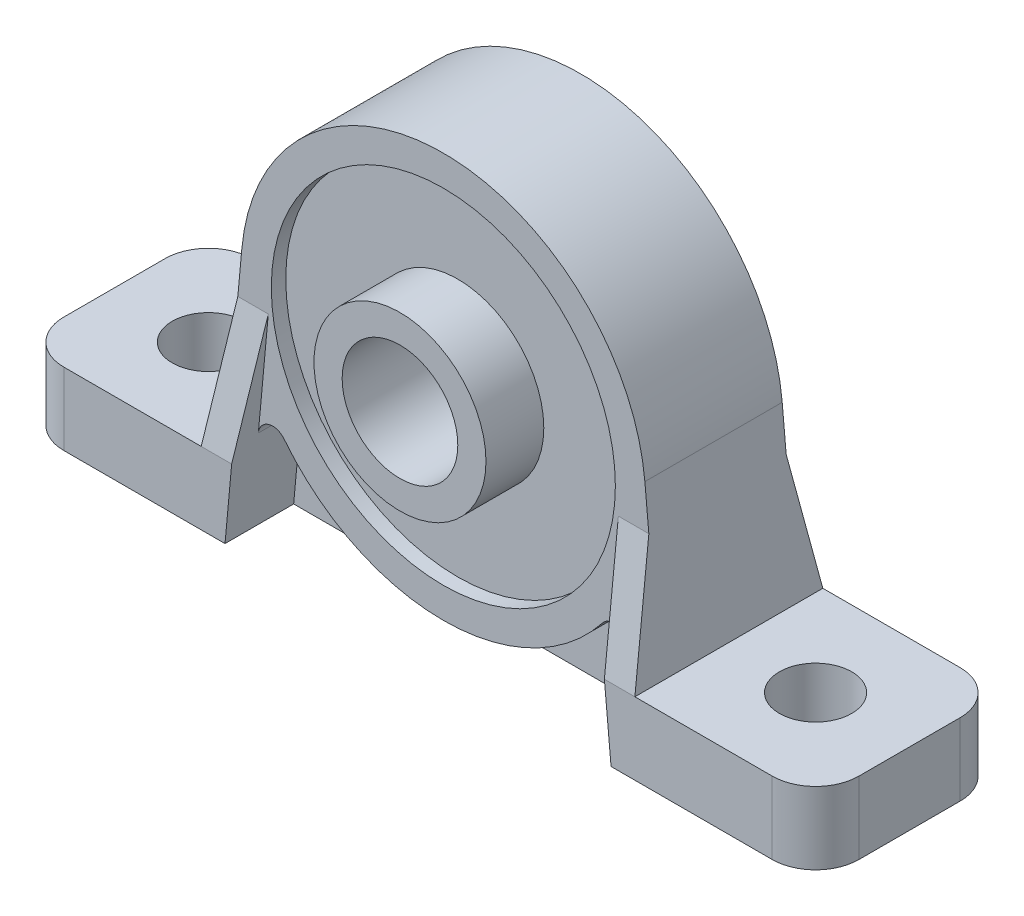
ISO-10303-21;
HEADER;
FILE_DESCRIPTION(('STEP AP214'),'2;1');
FILE_NAME('part.step','',(''),(''),'','','');
FILE_SCHEMA(('AUTOMOTIVE_DESIGN { 1 0 10303 214 1 1 1 1 }'));
ENDSEC;
DATA;
#1=APPLICATION_CONTEXT('core data for automotive mechanical design processes');
#2=APPLICATION_PROTOCOL_DEFINITION('international standard','automotive_design',2000,#1);
#3=PRODUCT_CONTEXT('',#1,'mechanical');
#4=PRODUCT('Part','Part','',(#3));
#5=PRODUCT_RELATED_PRODUCT_CATEGORY('part','',(#4));
#6=PRODUCT_DEFINITION_FORMATION('','',#4);
#7=PRODUCT_DEFINITION_CONTEXT('part definition',#1,'design');
#8=PRODUCT_DEFINITION('design','',#6,#7);
#9=PRODUCT_DEFINITION_SHAPE('','',#8);
#10=(LENGTH_UNIT() NAMED_UNIT(*) SI_UNIT(.MILLI.,.METRE.));
#11=(NAMED_UNIT(*) PLANE_ANGLE_UNIT() SI_UNIT($,.RADIAN.));
#12=(NAMED_UNIT(*) SI_UNIT($,.STERADIAN.) SOLID_ANGLE_UNIT());
#13=UNCERTAINTY_MEASURE_WITH_UNIT(LENGTH_MEASURE(1.E-05),#10,'distance_accuracy_value','');
#14=(GEOMETRIC_REPRESENTATION_CONTEXT(3) GLOBAL_UNCERTAINTY_ASSIGNED_CONTEXT((#13)) GLOBAL_UNIT_ASSIGNED_CONTEXT((#10,
#11,#12)) REPRESENTATION_CONTEXT('',''));
#15=CARTESIAN_POINT('',(0.,0.,0.));
#16=DIRECTION('',(0.,0.,1.));
#17=DIRECTION('',(1.,0.,0.));
#18=AXIS2_PLACEMENT_3D('',#15,#16,#17);
#19=CARTESIAN_POINT('',(0.,15.2,3.75));
#20=DIRECTION('',(0.,0.,1.));
#21=DIRECTION('',(1.,0.,0.));
#22=AXIS2_PLACEMENT_3D('',#19,#20,#21);
#23=PLANE('',#22);
#24=CARTESIAN_POINT('',(0.,15.2,3.75));
#25=DIRECTION('',(0.,0.,1.));
#26=DIRECTION('',(1.,0.,0.));
#27=AXIS2_PLACEMENT_3D('',#24,#25,#26);
#28=CIRCLE('',#27,11.9);
#29=CARTESIAN_POINT('',(11.9,15.2,3.75));
#30=VERTEX_POINT('',#29);
#31=EDGE_CURVE('E321',#30,#30,#28,.T.);
#32=ORIENTED_EDGE('',*,*,#31,.T.);
#33=EDGE_LOOP('',(#32));
#34=FACE_BOUND('',#33,.T.);
#35=CARTESIAN_POINT('',(0.,15.2,3.75));
#36=DIRECTION('',(0.,0.,1.));
#37=DIRECTION('',(1.,0.,0.));
#38=AXIS2_PLACEMENT_3D('',#35,#36,#37);
#39=CIRCLE('',#38,5.95);
#40=CARTESIAN_POINT('',(5.95,15.2,3.75));
#41=VERTEX_POINT('',#40);
#42=EDGE_CURVE('E660',#41,#41,#39,.T.);
#43=ORIENTED_EDGE('',*,*,#42,.F.);
#44=EDGE_LOOP('',(#43));
#45=FACE_BOUND('',#44,.T.);
#46=ADVANCED_FACE('F16',(#34,#45),#23,.T.);
#47=CARTESIAN_POINT('',(-27.5,0.,6.5));
#48=DIRECTION('',(0.,1.,0.));
#49=DIRECTION('',(0.,0.,1.));
#50=AXIS2_PLACEMENT_3D('',#47,#48,#49);
#51=PLANE('',#50);
#52=CARTESIAN_POINT('',(-21.,0.,0.));
#53=DIRECTION('',(0.,1.,0.));
#54=DIRECTION('',(-1.,0.,0.));
#55=AXIS2_PLACEMENT_3D('',#52,#53,#54);
#56=CIRCLE('',#55,2.5);
#57=CARTESIAN_POINT('',(-23.5,0.,0.));
#58=VERTEX_POINT('',#57);
#59=EDGE_CURVE('E643',#58,#58,#56,.T.);
#60=ORIENTED_EDGE('',*,*,#59,.T.);
#61=EDGE_LOOP('',(#60));
#62=FACE_BOUND('',#61,.T.);
#63=CARTESIAN_POINT('',(21.,0.,0.));
#64=DIRECTION('',(0.,1.,0.));
#65=DIRECTION('',(1.,0.,0.));
#66=AXIS2_PLACEMENT_3D('',#63,#64,#65);
#67=CIRCLE('',#66,2.5);
#68=CARTESIAN_POINT('',(23.5,0.,0.));
#69=VERTEX_POINT('',#68);
#70=EDGE_CURVE('E648',#69,#69,#67,.T.);
#71=ORIENTED_EDGE('',*,*,#70,.T.);
#72=EDGE_LOOP('',(#71));
#73=FACE_BOUND('',#72,.T.);
#74=DIRECTION('',(0.,0.,-1.));
#75=VECTOR('',#74,1.);
#76=CARTESIAN_POINT('',(-27.5,0.,6.5));
#77=LINE('',#76,#75);
#78=CARTESIAN_POINT('',(-27.5,0.,3.5));
#79=VERTEX_POINT('',#78);
#80=CARTESIAN_POINT('',(-27.5,0.,-3.5));
#81=VERTEX_POINT('',#80);
#82=EDGE_CURVE('E394',#79,#81,#77,.T.);
#83=ORIENTED_EDGE('',*,*,#82,.T.);
#84=CARTESIAN_POINT('',(-24.5,0.,-3.5));
#85=DIRECTION('',(0.,1.,0.));
#86=DIRECTION('',(0.,0.,1.));
#87=AXIS2_PLACEMENT_3D('',#84,#85,#86);
#88=CIRCLE('',#87,3.);
#89=CARTESIAN_POINT('',(-24.5,0.,-6.5));
#90=VERTEX_POINT('',#89);
#91=EDGE_CURVE('E444',#81,#90,#88,.F.);
#92=ORIENTED_EDGE('',*,*,#91,.T.);
#93=DIRECTION('',(1.,0.,0.));
#94=VECTOR('',#93,1.);
#95=CARTESIAN_POINT('',(-27.5,0.,-6.5));
#96=LINE('',#95,#94);
#97=CARTESIAN_POINT('',(-13.3521683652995,0.,-6.5));
#98=VERTEX_POINT('',#97);
#99=EDGE_CURVE('E222',#90,#98,#96,.T.);
#100=ORIENTED_EDGE('',*,*,#99,.T.);
#101=DIRECTION('',(0.,0.,1.));
#102=VECTOR('',#101,1.);
#103=CARTESIAN_POINT('',(-13.3521683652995,0.,-6.5));
#104=LINE('',#103,#102);
#105=CARTESIAN_POINT('',(-13.3521683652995,0.,-1.75));
#106=VERTEX_POINT('',#105);
#107=EDGE_CURVE('E214',#98,#106,#104,.T.);
#108=ORIENTED_EDGE('',*,*,#107,.T.);
#109=DIRECTION('',(1.,0.,0.));
#110=VECTOR('',#109,1.);
#111=CARTESIAN_POINT('',(-13.3521683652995,0.,-1.75));
#112=LINE('',#111,#110);
#113=CARTESIAN_POINT('',(13.3521683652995,0.,-1.75));
#114=VERTEX_POINT('',#113);
#115=EDGE_CURVE('E220',#106,#114,#112,.T.);
#116=ORIENTED_EDGE('',*,*,#115,.T.);
#117=DIRECTION('',(0.,0.,1.));
#118=VECTOR('',#117,1.);
#119=CARTESIAN_POINT('',(13.3521683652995,0.,-6.5));
#120=LINE('',#119,#118);
#121=CARTESIAN_POINT('',(13.3521683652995,0.,-6.5));
#122=VERTEX_POINT('',#121);
#123=EDGE_CURVE('E225',#122,#114,#120,.T.);
#124=ORIENTED_EDGE('',*,*,#123,.F.);
#125=CARTESIAN_POINT('',(24.5,0.,-6.5));
#126=VERTEX_POINT('',#125);
#127=EDGE_CURVE('E384',#122,#126,#96,.T.);
#128=ORIENTED_EDGE('',*,*,#127,.T.);
#129=CARTESIAN_POINT('',(24.5,0.,-3.5));
#130=DIRECTION('',(0.,1.,0.));
#131=DIRECTION('',(0.,0.,1.));
#132=AXIS2_PLACEMENT_3D('',#129,#130,#131);
#133=CIRCLE('',#132,3.);
#134=CARTESIAN_POINT('',(27.5,0.,-3.5));
#135=VERTEX_POINT('',#134);
#136=EDGE_CURVE('E442',#126,#135,#133,.F.);
#137=ORIENTED_EDGE('',*,*,#136,.T.);
#138=DIRECTION('',(0.,0.,-1.));
#139=VECTOR('',#138,1.);
#140=CARTESIAN_POINT('',(27.5,0.,6.5));
#141=LINE('',#140,#139);
#142=CARTESIAN_POINT('',(27.5,0.,3.5));
#143=VERTEX_POINT('',#142);
#144=EDGE_CURVE('E391',#143,#135,#141,.T.);
#145=ORIENTED_EDGE('',*,*,#144,.F.);
#146=CARTESIAN_POINT('',(24.5,0.,3.5));
#147=DIRECTION('',(0.,1.,0.));
#148=DIRECTION('',(0.,0.,1.));
#149=AXIS2_PLACEMENT_3D('',#146,#147,#148);
#150=CIRCLE('',#149,3.);
#151=CARTESIAN_POINT('',(24.5,0.,6.5));
#152=VERTEX_POINT('',#151);
#153=EDGE_CURVE('E440',#143,#152,#150,.F.);
#154=ORIENTED_EDGE('',*,*,#153,.T.);
#155=DIRECTION('',(1.,0.,0.));
#156=VECTOR('',#155,1.);
#157=CARTESIAN_POINT('',(-27.5,0.,6.5));
#158=LINE('',#157,#156);
#159=CARTESIAN_POINT('',(13.3521683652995,0.,6.5));
#160=VERTEX_POINT('',#159);
#161=EDGE_CURVE('E375',#160,#152,#158,.T.);
#162=ORIENTED_EDGE('',*,*,#161,.F.);
#163=DIRECTION('',(0.,0.,-1.));
#164=VECTOR('',#163,1.);
#165=CARTESIAN_POINT('',(13.3521683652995,0.,6.5));
#166=LINE('',#165,#164);
#167=CARTESIAN_POINT('',(13.3521683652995,0.,1.75));
#168=VERTEX_POINT('',#167);
#169=EDGE_CURVE('E333',#160,#168,#166,.T.);
#170=ORIENTED_EDGE('',*,*,#169,.T.);
#171=DIRECTION('',(1.,0.,0.));
#172=VECTOR('',#171,1.);
#173=CARTESIAN_POINT('',(-13.3521683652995,0.,1.75));
#174=LINE('',#173,#172);
#175=CARTESIAN_POINT('',(-13.3521683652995,0.,1.75));
#176=VERTEX_POINT('',#175);
#177=EDGE_CURVE('E286',#176,#168,#174,.T.);
#178=ORIENTED_EDGE('',*,*,#177,.F.);
#179=DIRECTION('',(0.,0.,-1.));
#180=VECTOR('',#179,1.);
#181=CARTESIAN_POINT('',(-13.3521683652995,0.,6.5));
#182=LINE('',#181,#180);
#183=CARTESIAN_POINT('',(-13.3521683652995,0.,6.5));
#184=VERTEX_POINT('',#183);
#185=EDGE_CURVE('E338',#184,#176,#182,.T.);
#186=ORIENTED_EDGE('',*,*,#185,.F.);
#187=CARTESIAN_POINT('',(-24.5,0.,6.5));
#188=VERTEX_POINT('',#187);
#189=EDGE_CURVE('E377',#188,#184,#158,.T.);
#190=ORIENTED_EDGE('',*,*,#189,.F.);
#191=CARTESIAN_POINT('',(-24.5,0.,3.5));
#192=DIRECTION('',(0.,1.,0.));
#193=DIRECTION('',(0.,0.,1.));
#194=AXIS2_PLACEMENT_3D('',#191,#192,#193);
#195=CIRCLE('',#194,3.);
#196=EDGE_CURVE('E438',#188,#79,#195,.F.);
#197=ORIENTED_EDGE('',*,*,#196,.T.);
#198=EDGE_LOOP('',(#83,#92,#100,#108,#116,#124,#128,#137,#145,#154,#162,#170,#178,#186,#190,#197));
#199=FACE_BOUND('',#198,.T.);
#200=ADVANCED_FACE('F217',(#62,#73,#199),#51,.F.);
#201=CARTESIAN_POINT('',(-27.5,29.2,-4.75));
#202=DIRECTION('',(0.,0.,1.));
#203=DIRECTION('',(0.,-1.,0.));
#204=AXIS2_PLACEMENT_3D('',#201,#202,#203);
#205=PLANE('',#204);
#206=CARTESIAN_POINT('',(0.,15.2,-4.75));
#207=DIRECTION('',(0.,0.,1.));
#208=DIRECTION('',(1.,0.,0.));
#209=AXIS2_PLACEMENT_3D('',#206,#207,#208);
#210=CIRCLE('',#209,11.9);
#211=CARTESIAN_POINT('',(11.9,15.2,-4.75));
#212=VERTEX_POINT('',#211);
#213=EDGE_CURVE('E265',#212,#212,#210,.T.);
#214=ORIENTED_EDGE('',*,*,#213,.T.);
#215=EDGE_LOOP('',(#214));
#216=FACE_BOUND('',#215,.T.);
#217=CARTESIAN_POINT('',(11.8002023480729,5.9395883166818,-4.75));
#218=DIRECTION('',(0.,0.,1.));
#219=DIRECTION('',(-1.,0.,0.));
#220=AXIS2_PLACEMENT_3D('',#217,#218,#219);
#221=CIRCLE('',#220,1.);
#222=CARTESIAN_POINT('',(12.7959774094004,6.03141438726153,-4.75));
#223=VERTEX_POINT('',#222);
#224=CARTESIAN_POINT('',(11.0135221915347,6.55694909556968,-4.75));
#225=VERTEX_POINT('',#224);
#226=EDGE_CURVE('E242',#223,#225,#221,.T.);
#227=ORIENTED_EDGE('',*,*,#226,.T.);
#228=CARTESIAN_POINT('',(0.,15.2,-4.75));
#229=DIRECTION('',(0.,0.,-1.));
#230=DIRECTION('',(1.,0.,0.));
#231=AXIS2_PLACEMENT_3D('',#228,#229,#230);
#232=CIRCLE('',#231,14.);
#233=CARTESIAN_POINT('',(-11.0135221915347,6.55694909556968,-4.75));
#234=VERTEX_POINT('',#233);
#235=EDGE_CURVE('E245',#225,#234,#232,.T.);
#236=ORIENTED_EDGE('',*,*,#235,.T.);
#237=CARTESIAN_POINT('',(-11.8002023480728,5.93958831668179,-4.75));
#238=DIRECTION('',(0.,0.,1.));
#239=DIRECTION('',(1.,0.,0.));
#240=AXIS2_PLACEMENT_3D('',#237,#238,#239);
#241=CIRCLE('',#240,1.);
#242=CARTESIAN_POINT('',(-12.7959774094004,6.03141438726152,-4.75));
#243=VERTEX_POINT('',#242);
#244=EDGE_CURVE('E257',#234,#243,#241,.T.);
#245=ORIENTED_EDGE('',*,*,#244,.T.);
#246=DIRECTION('',(-0.0918260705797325,-0.99577506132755,0.));
#247=VECTOR('',#246,1.);
#248=CARTESIAN_POINT('',(-12.125039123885,13.3071652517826,-4.75));
#249=LINE('',#248,#247);
#250=CARTESIAN_POINT('',(-12.1072567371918,13.5,-4.75));
#251=VERTEX_POINT('',#250);
#252=EDGE_CURVE('E274',#251,#243,#249,.T.);
#253=ORIENTED_EDGE('',*,*,#252,.F.);
#254=DIRECTION('',(1.,0.,0.));
#255=VECTOR('',#254,1.);
#256=CARTESIAN_POINT('',(-27.5,13.5,-4.75));
#257=LINE('',#256,#255);
#258=CARTESIAN_POINT('',(-14.2161667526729,13.5,-4.75));
#259=VERTEX_POINT('',#258);
#260=EDGE_CURVE('E346',#259,#251,#257,.T.);
#261=ORIENTED_EDGE('',*,*,#260,.F.);
#262=DIRECTION('',(-0.0918260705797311,-0.99577506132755,0.));
#263=VECTOR('',#262,1.);
#264=CARTESIAN_POINT('',(-15.,5.,-4.75));
#265=LINE('',#264,#263);
#266=CARTESIAN_POINT('',(-13.9408508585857,16.4855649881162,-4.75));
#267=VERTEX_POINT('',#266);
#268=EDGE_CURVE('E416',#267,#259,#265,.T.);
#269=ORIENTED_EDGE('',*,*,#268,.F.);
#270=CARTESIAN_POINT('',(0.,15.2,-4.75));
#271=DIRECTION('',(0.,0.,1.));
#272=DIRECTION('',(0.,-1.,0.));
#273=AXIS2_PLACEMENT_3D('',#270,#271,#272);
#274=CIRCLE('',#273,14.);
#275=CARTESIAN_POINT('',(13.9408508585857,16.4855649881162,-4.75));
#276=VERTEX_POINT('',#275);
#277=EDGE_CURVE('E360',#276,#267,#274,.T.);
#278=ORIENTED_EDGE('',*,*,#277,.F.);
#279=DIRECTION('',(-0.0918260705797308,0.99577506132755,0.));
#280=VECTOR('',#279,1.);
#281=CARTESIAN_POINT('',(15.,5.,-4.75));
#282=LINE('',#281,#280);
#283=CARTESIAN_POINT('',(14.2161667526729,13.5,-4.75));
#284=VERTEX_POINT('',#283);
#285=EDGE_CURVE('E362',#284,#276,#282,.T.);
#286=ORIENTED_EDGE('',*,*,#285,.F.);
#287=CARTESIAN_POINT('',(12.1072567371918,13.5,-4.75));
#288=VERTEX_POINT('',#287);
#289=EDGE_CURVE('E340',#288,#284,#257,.T.);
#290=ORIENTED_EDGE('',*,*,#289,.F.);
#291=DIRECTION('',(-0.0918260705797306,0.99577506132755,0.));
#292=VECTOR('',#291,1.);
#293=CARTESIAN_POINT('',(12.1250391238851,13.3071652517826,-4.75));
#294=LINE('',#293,#292);
#295=EDGE_CURVE('E279',#223,#288,#294,.T.);
#296=ORIENTED_EDGE('',*,*,#295,.F.);
#297=EDGE_LOOP('',(#227,#236,#245,#253,#261,#269,#278,#286,#290,#296));
#298=FACE_BOUND('',#297,.T.);
#299=ADVANCED_FACE('F508',(#216,#298),#205,.F.);
#300=CARTESIAN_POINT('',(0.,15.2,-6.5));
#301=DIRECTION('',(0.,0.,1.));
#302=DIRECTION('',(1.,0.,0.));
#303=AXIS2_PLACEMENT_3D('',#300,#301,#302);
#304=PLANE('',#303);
#305=ORIENTED_EDGE('',*,*,#99,.F.);
#306=DIRECTION('',(0.,-1.,0.));
#307=VECTOR('',#306,1.);
#308=CARTESIAN_POINT('',(-24.5,15.2,-6.5));
#309=LINE('',#308,#307);
#310=CARTESIAN_POINT('',(-24.5,5.,-6.5));
#311=VERTEX_POINT('',#310);
#312=EDGE_CURVE('E446',#90,#311,#309,.F.);
#313=ORIENTED_EDGE('',*,*,#312,.T.);
#314=DIRECTION('',(-1.,0.,0.));
#315=VECTOR('',#314,1.);
#316=CARTESIAN_POINT('',(-27.5,5.,-6.5));
#317=LINE('',#316,#315);
#318=CARTESIAN_POINT('',(-15.,5.,-6.5));
#319=VERTEX_POINT('',#318);
#320=EDGE_CURVE('E371',#319,#311,#317,.T.);
#321=ORIENTED_EDGE('',*,*,#320,.F.);
#322=DIRECTION('',(1.,0.,0.));
#323=VECTOR('',#322,1.);
#324=CARTESIAN_POINT('',(0.,5.,-6.5));
#325=LINE('',#324,#323);
#326=CARTESIAN_POINT('',(-12.8910899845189,5.,-6.5));
#327=VERTEX_POINT('',#326);
#328=EDGE_CURVE('E409',#319,#327,#325,.T.);
#329=ORIENTED_EDGE('',*,*,#328,.T.);
#330=DIRECTION('',(-0.0918260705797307,-0.99577506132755,0.));
#331=VECTOR('',#330,1.);
#332=CARTESIAN_POINT('',(-13.3521683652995,0.,-6.5));
#333=LINE('',#332,#331);
#334=EDGE_CURVE('E277',#327,#98,#333,.T.);
#335=ORIENTED_EDGE('',*,*,#334,.T.);
#336=EDGE_LOOP('',(#305,#313,#321,#329,#335));
#337=FACE_BOUND('',#336,.T.);
#338=ADVANCED_FACE('F676',(#337),#304,.F.);
#339=CARTESIAN_POINT('',(-27.5,13.5,-4.75));
#340=DIRECTION('',(0.,-0.201652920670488,0.979457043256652));
#341=DIRECTION('',(0.,-0.979457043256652,-0.201652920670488));
#342=AXIS2_PLACEMENT_3D('',#339,#340,#341);
#343=PLANE('',#342);
#344=ORIENTED_EDGE('',*,*,#260,.T.);
#345=DIRECTION('',(-0.089955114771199,-0.975486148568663,-0.200835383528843));
#346=VECTOR('',#345,1.);
#347=CARTESIAN_POINT('',(-12.2318136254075,12.1492872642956,-5.02808791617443));
#348=LINE('',#347,#346);
#349=EDGE_CURVE('E430',#251,#327,#348,.T.);
#350=ORIENTED_EDGE('',*,*,#349,.T.);
#351=ORIENTED_EDGE('',*,*,#328,.F.);
#352=DIRECTION('',(-0.0899551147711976,-0.975486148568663,-0.200835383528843));
#353=VECTOR('',#352,1.);
#354=CARTESIAN_POINT('',(-14.7651397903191,7.54685775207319,-5.97564693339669));
#355=LINE('',#354,#353);
#356=EDGE_CURVE('E344',#259,#319,#355,.T.);
#357=ORIENTED_EDGE('',*,*,#356,.F.);
#358=EDGE_LOOP('',(#344,#350,#351,#357));
#359=FACE_BOUND('',#358,.T.);
#360=ADVANCED_FACE('F682',(#359),#343,.F.);
#361=CARTESIAN_POINT('',(0.,15.2,6.5));
#362=DIRECTION('',(0.,0.,1.));
#363=DIRECTION('',(1.,0.,0.));
#364=AXIS2_PLACEMENT_3D('',#361,#362,#363);
#365=PLANE('',#364);
#366=ORIENTED_EDGE('',*,*,#161,.T.);
#367=DIRECTION('',(0.,1.,0.));
#368=VECTOR('',#367,1.);
#369=CARTESIAN_POINT('',(24.5,5.,6.5));
#370=LINE('',#369,#368);
#371=CARTESIAN_POINT('',(24.5,5.,6.5));
#372=VERTEX_POINT('',#371);
#373=EDGE_CURVE('E24',#152,#372,#370,.T.);
#374=ORIENTED_EDGE('',*,*,#373,.T.);
#375=DIRECTION('',(-1.,0.,0.));
#376=VECTOR('',#375,1.);
#377=CARTESIAN_POINT('',(27.5,5.,6.5));
#378=LINE('',#377,#376);
#379=CARTESIAN_POINT('',(15.,5.,6.5));
#380=VERTEX_POINT('',#379);
#381=EDGE_CURVE('E379',#372,#380,#378,.T.);
#382=ORIENTED_EDGE('',*,*,#381,.T.);
#383=DIRECTION('',(1.,0.,0.));
#384=VECTOR('',#383,1.);
#385=CARTESIAN_POINT('',(0.,5.,6.5));
#386=LINE('',#385,#384);
#387=CARTESIAN_POINT('',(12.8910899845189,5.,6.5));
#388=VERTEX_POINT('',#387);
#389=EDGE_CURVE('E412',#388,#380,#386,.T.);
#390=ORIENTED_EDGE('',*,*,#389,.F.);
#391=DIRECTION('',(-0.0918260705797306,0.99577506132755,0.));
#392=VECTOR('',#391,1.);
#393=CARTESIAN_POINT('',(12.1250391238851,13.3071652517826,6.5));
#394=LINE('',#393,#392);
#395=EDGE_CURVE('E330',#160,#388,#394,.T.);
#396=ORIENTED_EDGE('',*,*,#395,.F.);
#397=EDGE_LOOP('',(#366,#374,#382,#390,#396));
#398=FACE_BOUND('',#397,.T.);
#399=ADVANCED_FACE('F463',(#398),#365,.T.);
#400=DIRECTION('',(-1.,0.,0.));
#401=VECTOR('',#400,1.);
#402=CARTESIAN_POINT('',(-27.5,5.,6.5));
#403=LINE('',#402,#401);
#404=CARTESIAN_POINT('',(-15.,5.,6.5));
#405=VERTEX_POINT('',#404);
#406=CARTESIAN_POINT('',(-24.5,5.,6.5));
#407=VERTEX_POINT('',#406);
#408=EDGE_CURVE('E372',#405,#407,#403,.T.);
#409=ORIENTED_EDGE('',*,*,#408,.T.);
#410=DIRECTION('',(0.,-1.,0.));
#411=VECTOR('',#410,1.);
#412=CARTESIAN_POINT('',(-24.5,0.,6.5));
#413=LINE('',#412,#411);
#414=EDGE_CURVE('E10',#407,#188,#413,.T.);
#415=ORIENTED_EDGE('',*,*,#414,.T.);
#416=ORIENTED_EDGE('',*,*,#189,.T.);
#417=DIRECTION('',(-0.0918260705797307,-0.99577506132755,0.));
#418=VECTOR('',#417,1.);
#419=CARTESIAN_POINT('',(-13.3521683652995,0.,6.5));
#420=LINE('',#419,#418);
#421=CARTESIAN_POINT('',(-12.8910899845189,5.,6.5));
#422=VERTEX_POINT('',#421);
#423=EDGE_CURVE('E327',#422,#184,#420,.T.);
#424=ORIENTED_EDGE('',*,*,#423,.F.);
#425=EDGE_CURVE('E413',#405,#422,#386,.T.);
#426=ORIENTED_EDGE('',*,*,#425,.F.);
#427=EDGE_LOOP('',(#409,#415,#416,#424,#426));
#428=FACE_BOUND('',#427,.T.);
#429=ADVANCED_FACE('F526',(#428),#365,.T.);
#430=CARTESIAN_POINT('',(-27.5,13.5,4.75));
#431=DIRECTION('',(0.,-0.201652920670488,-0.979457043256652));
#432=DIRECTION('',(0.,0.979457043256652,-0.201652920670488));
#433=AXIS2_PLACEMENT_3D('',#430,#431,#432);
#434=PLANE('',#433);
#435=DIRECTION('',(-0.0899551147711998,0.975486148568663,-0.200835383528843));
#436=VECTOR('',#435,1.);
#437=CARTESIAN_POINT('',(11.786757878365,16.9755355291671,4.0344485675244));
#438=LINE('',#437,#436);
#439=CARTESIAN_POINT('',(12.1072567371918,13.5,4.75));
#440=VERTEX_POINT('',#439);
#441=EDGE_CURVE('E424',#388,#440,#438,.T.);
#442=ORIENTED_EDGE('',*,*,#441,.F.);
#443=ORIENTED_EDGE('',*,*,#389,.T.);
#444=DIRECTION('',(0.0899551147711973,-0.975486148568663,0.200835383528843));
#445=VECTOR('',#444,1.);
#446=CARTESIAN_POINT('',(15.,5.,6.5));
#447=LINE('',#446,#445);
#448=CARTESIAN_POINT('',(14.2161667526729,13.5,4.75));
#449=VERTEX_POINT('',#448);
#450=EDGE_CURVE('E357',#449,#380,#447,.T.);
#451=ORIENTED_EDGE('',*,*,#450,.F.);
#452=DIRECTION('',(1.,0.,0.));
#453=VECTOR('',#452,1.);
#454=CARTESIAN_POINT('',(-27.5,13.5,4.75));
#455=LINE('',#454,#453);
#456=EDGE_CURVE('E345',#440,#449,#455,.T.);
#457=ORIENTED_EDGE('',*,*,#456,.F.);
#458=EDGE_LOOP('',(#442,#443,#451,#457));
#459=FACE_BOUND('',#458,.T.);
#460=ADVANCED_FACE('F481',(#459),#434,.F.);
#461=DIRECTION('',(-0.089955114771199,-0.975486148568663,0.200835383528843));
#462=VECTOR('',#461,1.);
#463=CARTESIAN_POINT('',(-12.2318136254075,12.1492872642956,5.02808791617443));
#464=LINE('',#463,#462);
#465=CARTESIAN_POINT('',(-12.1072567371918,13.5,4.75));
#466=VERTEX_POINT('',#465);
#467=EDGE_CURVE('E422',#466,#422,#464,.T.);
#468=ORIENTED_EDGE('',*,*,#467,.F.);
#469=CARTESIAN_POINT('',(-14.2161667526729,13.5,4.75));
#470=VERTEX_POINT('',#469);
#471=EDGE_CURVE('E341',#470,#466,#455,.T.);
#472=ORIENTED_EDGE('',*,*,#471,.F.);
#473=DIRECTION('',(0.0899551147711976,0.975486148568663,-0.200835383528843));
#474=VECTOR('',#473,1.);
#475=CARTESIAN_POINT('',(-15.,5.,6.5));
#476=LINE('',#475,#474);
#477=EDGE_CURVE('E354',#405,#470,#476,.T.);
#478=ORIENTED_EDGE('',*,*,#477,.F.);
#479=ORIENTED_EDGE('',*,*,#425,.T.);
#480=EDGE_LOOP('',(#468,#472,#478,#479));
#481=FACE_BOUND('',#480,.T.);
#482=ADVANCED_FACE('F523',(#481),#434,.F.);
#483=CARTESIAN_POINT('',(15.,5.,6.5));
#484=DIRECTION('',(-0.99577506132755,-0.0918260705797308,0.));
#485=DIRECTION('',(0.0918260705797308,-0.99577506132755,0.));
#486=AXIS2_PLACEMENT_3D('',#483,#484,#485);
#487=PLANE('',#486);
#488=DIRECTION('',(0.,0.,-1.));
#489=VECTOR('',#488,1.);
#490=CARTESIAN_POINT('',(13.9408508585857,16.4855649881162,6.5));
#491=LINE('',#490,#489);
#492=CARTESIAN_POINT('',(13.9408508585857,16.4855649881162,4.75));
#493=VERTEX_POINT('',#492);
#494=EDGE_CURVE('E405',#493,#276,#491,.T.);
#495=ORIENTED_EDGE('',*,*,#494,.F.);
#496=DIRECTION('',(0.0918260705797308,-0.99577506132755,0.));
#497=VECTOR('',#496,1.);
#498=CARTESIAN_POINT('',(15.,5.,4.75));
#499=LINE('',#498,#497);
#500=EDGE_CURVE('E368',#493,#449,#499,.T.);
#501=ORIENTED_EDGE('',*,*,#500,.T.);
#502=ORIENTED_EDGE('',*,*,#450,.T.);
#503=DIRECTION('',(0.,0.,-1.));
#504=VECTOR('',#503,1.);
#505=CARTESIAN_POINT('',(15.,5.,6.5));
#506=LINE('',#505,#504);
#507=CARTESIAN_POINT('',(15.,5.,-6.5));
#508=VERTEX_POINT('',#507);
#509=EDGE_CURVE('E381',#380,#508,#506,.T.);
#510=ORIENTED_EDGE('',*,*,#509,.T.);
#511=DIRECTION('',(-0.0899551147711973,0.975486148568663,0.200835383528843));
#512=VECTOR('',#511,1.);
#513=CARTESIAN_POINT('',(14.7651397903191,7.54685775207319,-5.97564693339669));
#514=LINE('',#513,#512);
#515=EDGE_CURVE('E351',#508,#284,#514,.T.);
#516=ORIENTED_EDGE('',*,*,#515,.T.);
#517=ORIENTED_EDGE('',*,*,#285,.T.);
#518=EDGE_LOOP('',(#495,#501,#502,#510,#516,#517));
#519=FACE_BOUND('',#518,.T.);
#520=ADVANCED_FACE('F475',(#519),#487,.F.);
#521=CARTESIAN_POINT('',(0.,15.2,6.5));
#522=DIRECTION('',(0.,0.,-1.));
#523=DIRECTION('',(-1.,0.,0.));
#524=AXIS2_PLACEMENT_3D('',#521,#522,#523);
#525=CYLINDRICAL_SURFACE('',#524,14.);
#526=DIRECTION('',(0.,0.,-1.));
#527=VECTOR('',#526,1.);
#528=CARTESIAN_POINT('',(-13.9408508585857,16.4855649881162,6.5));
#529=LINE('',#528,#527);
#530=CARTESIAN_POINT('',(-13.9408508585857,16.4855649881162,4.75));
#531=VERTEX_POINT('',#530);
#532=EDGE_CURVE('E402',#531,#267,#529,.T.);
#533=ORIENTED_EDGE('',*,*,#532,.F.);
#534=CARTESIAN_POINT('',(0.,15.2,4.75));
#535=DIRECTION('',(0.,0.,-1.));
#536=DIRECTION('',(0.,1.,0.));
#537=AXIS2_PLACEMENT_3D('',#534,#535,#536);
#538=CIRCLE('',#537,14.);
#539=EDGE_CURVE('E365',#531,#493,#538,.T.);
#540=ORIENTED_EDGE('',*,*,#539,.T.);
#541=ORIENTED_EDGE('',*,*,#494,.T.);
#542=ORIENTED_EDGE('',*,*,#277,.T.);
#543=EDGE_LOOP('',(#533,#540,#541,#542));
#544=FACE_BOUND('',#543,.T.);
#545=ADVANCED_FACE('F512',(#544),#525,.T.);
#546=CARTESIAN_POINT('',(-15.,5.,6.5));
#547=DIRECTION('',(0.99577506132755,-0.0918260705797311,0.));
#548=DIRECTION('',(0.0918260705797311,0.99577506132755,0.));
#549=AXIS2_PLACEMENT_3D('',#546,#547,#548);
#550=PLANE('',#549);
#551=ORIENTED_EDGE('',*,*,#477,.T.);
#552=DIRECTION('',(0.0918260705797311,0.99577506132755,0.));
#553=VECTOR('',#552,1.);
#554=CARTESIAN_POINT('',(-15.,5.,4.75));
#555=LINE('',#554,#553);
#556=EDGE_CURVE('E419',#470,#531,#555,.T.);
#557=ORIENTED_EDGE('',*,*,#556,.T.);
#558=ORIENTED_EDGE('',*,*,#532,.T.);
#559=ORIENTED_EDGE('',*,*,#268,.T.);
#560=ORIENTED_EDGE('',*,*,#356,.T.);
#561=DIRECTION('',(0.,0.,-1.));
#562=VECTOR('',#561,1.);
#563=CARTESIAN_POINT('',(-15.,5.,6.5));
#564=LINE('',#563,#562);
#565=EDGE_CURVE('E399',#405,#319,#564,.T.);
#566=ORIENTED_EDGE('',*,*,#565,.F.);
#567=EDGE_LOOP('',(#551,#557,#558,#559,#560,#566));
#568=FACE_BOUND('',#567,.T.);
#569=ADVANCED_FACE('F517',(#568),#550,.F.);
#570=CARTESIAN_POINT('',(-27.5,5.,6.5));
#571=DIRECTION('',(0.,-1.,0.));
#572=DIRECTION('',(1.,0.,0.));
#573=AXIS2_PLACEMENT_3D('',#570,#571,#572);
#574=PLANE('',#573);
#575=CARTESIAN_POINT('',(-21.,5.,0.));
#576=DIRECTION('',(0.,1.,0.));
#577=DIRECTION('',(-1.,0.,0.));
#578=AXIS2_PLACEMENT_3D('',#575,#576,#577);
#579=CIRCLE('',#578,2.5);
#580=CARTESIAN_POINT('',(-23.5,5.,0.));
#581=VERTEX_POINT('',#580);
#582=EDGE_CURVE('E646',#581,#581,#579,.T.);
#583=ORIENTED_EDGE('',*,*,#582,.F.);
#584=EDGE_LOOP('',(#583));
#585=FACE_BOUND('',#584,.T.);
#586=ORIENTED_EDGE('',*,*,#320,.T.);
#587=CARTESIAN_POINT('',(-24.5,5.,-3.5));
#588=DIRECTION('',(0.,-1.,0.));
#589=DIRECTION('',(1.,0.,0.));
#590=AXIS2_PLACEMENT_3D('',#587,#588,#589);
#591=CIRCLE('',#590,3.);
#592=CARTESIAN_POINT('',(-27.5,5.,-3.5));
#593=VERTEX_POINT('',#592);
#594=EDGE_CURVE('E450',#311,#593,#591,.F.);
#595=ORIENTED_EDGE('',*,*,#594,.T.);
#596=DIRECTION('',(0.,0.,-1.));
#597=VECTOR('',#596,1.);
#598=CARTESIAN_POINT('',(-27.5,5.,6.5));
#599=LINE('',#598,#597);
#600=CARTESIAN_POINT('',(-27.5,5.,3.5));
#601=VERTEX_POINT('',#600);
#602=EDGE_CURVE('E396',#601,#593,#599,.T.);
#603=ORIENTED_EDGE('',*,*,#602,.F.);
#604=CARTESIAN_POINT('',(-24.5,5.,3.5));
#605=DIRECTION('',(0.,-1.,0.));
#606=DIRECTION('',(1.,0.,0.));
#607=AXIS2_PLACEMENT_3D('',#604,#605,#606);
#608=CIRCLE('',#607,3.);
#609=EDGE_CURVE('E448',#601,#407,#608,.F.);
#610=ORIENTED_EDGE('',*,*,#609,.T.);
#611=ORIENTED_EDGE('',*,*,#408,.F.);
#612=ORIENTED_EDGE('',*,*,#565,.T.);
#613=EDGE_LOOP('',(#586,#595,#603,#610,#611,#612));
#614=FACE_BOUND('',#613,.T.);
#615=ADVANCED_FACE('F699',(#585,#614),#574,.F.);
#616=CARTESIAN_POINT('',(-27.5,0.,6.5));
#617=DIRECTION('',(1.,0.,0.));
#618=DIRECTION('',(0.,0.,-1.));
#619=AXIS2_PLACEMENT_3D('',#616,#617,#618);
#620=PLANE('',#619);
#621=ORIENTED_EDGE('',*,*,#602,.T.);
#622=DIRECTION('',(0.,-1.,0.));
#623=VECTOR('',#622,1.);
#624=CARTESIAN_POINT('',(-27.5,0.,-3.5));
#625=LINE('',#624,#623);
#626=EDGE_CURVE('E435',#593,#81,#625,.T.);
#627=ORIENTED_EDGE('',*,*,#626,.T.);
#628=ORIENTED_EDGE('',*,*,#82,.F.);
#629=DIRECTION('',(0.,-1.,0.));
#630=VECTOR('',#629,1.);
#631=CARTESIAN_POINT('',(-27.5,5.,3.5));
#632=LINE('',#631,#630);
#633=EDGE_CURVE('E433',#79,#601,#632,.F.);
#634=ORIENTED_EDGE('',*,*,#633,.T.);
#635=EDGE_LOOP('',(#621,#627,#628,#634));
#636=FACE_BOUND('',#635,.T.);
#637=ADVANCED_FACE('F695',(#636),#620,.F.);
#638=CARTESIAN_POINT('',(27.5,0.,6.5));
#639=DIRECTION('',(-1.,0.,0.));
#640=DIRECTION('',(0.,0.,1.));
#641=AXIS2_PLACEMENT_3D('',#638,#639,#640);
#642=PLANE('',#641);
#643=ORIENTED_EDGE('',*,*,#144,.T.);
#644=DIRECTION('',(0.,1.,0.));
#645=VECTOR('',#644,1.);
#646=CARTESIAN_POINT('',(27.5,0.,-3.5));
#647=LINE('',#646,#645);
#648=CARTESIAN_POINT('',(27.5,5.,-3.5));
#649=VERTEX_POINT('',#648);
#650=EDGE_CURVE('E454',#135,#649,#647,.T.);
#651=ORIENTED_EDGE('',*,*,#650,.T.);
#652=DIRECTION('',(0.,0.,-1.));
#653=VECTOR('',#652,1.);
#654=CARTESIAN_POINT('',(27.5,5.,6.5));
#655=LINE('',#654,#653);
#656=CARTESIAN_POINT('',(27.5,5.,3.5));
#657=VERTEX_POINT('',#656);
#658=EDGE_CURVE('E389',#657,#649,#655,.T.);
#659=ORIENTED_EDGE('',*,*,#658,.F.);
#660=DIRECTION('',(0.,1.,0.));
#661=VECTOR('',#660,1.);
#662=CARTESIAN_POINT('',(27.5,0.,3.5));
#663=LINE('',#662,#661);
#664=EDGE_CURVE('E452',#657,#143,#663,.F.);
#665=ORIENTED_EDGE('',*,*,#664,.T.);
#666=EDGE_LOOP('',(#643,#651,#659,#665));
#667=FACE_BOUND('',#666,.T.);
#668=ADVANCED_FACE('F488',(#667),#642,.F.);
#669=CARTESIAN_POINT('',(27.5,5.,6.5));
#670=DIRECTION('',(0.,-1.,0.));
#671=DIRECTION('',(1.,0.,0.));
#672=AXIS2_PLACEMENT_3D('',#669,#670,#671);
#673=PLANE('',#672);
#674=CARTESIAN_POINT('',(21.,5.,0.));
#675=DIRECTION('',(0.,1.,0.));
#676=DIRECTION('',(1.,0.,0.));
#677=AXIS2_PLACEMENT_3D('',#674,#675,#676);
#678=CIRCLE('',#677,2.5);
#679=CARTESIAN_POINT('',(23.5,5.,0.));
#680=VERTEX_POINT('',#679);
#681=EDGE_CURVE('E653',#680,#680,#678,.T.);
#682=ORIENTED_EDGE('',*,*,#681,.F.);
#683=EDGE_LOOP('',(#682));
#684=FACE_BOUND('',#683,.T.);
#685=ORIENTED_EDGE('',*,*,#658,.T.);
#686=CARTESIAN_POINT('',(24.5,5.,-3.5));
#687=DIRECTION('',(0.,-1.,0.));
#688=DIRECTION('',(1.,0.,0.));
#689=AXIS2_PLACEMENT_3D('',#686,#687,#688);
#690=CIRCLE('',#689,3.);
#691=CARTESIAN_POINT('',(24.5,5.,-6.5));
#692=VERTEX_POINT('',#691);
#693=EDGE_CURVE('E39',#649,#692,#690,.F.);
#694=ORIENTED_EDGE('',*,*,#693,.T.);
#695=DIRECTION('',(-1.,0.,0.));
#696=VECTOR('',#695,1.);
#697=CARTESIAN_POINT('',(27.5,5.,-6.5));
#698=LINE('',#697,#696);
#699=EDGE_CURVE('E376',#692,#508,#698,.T.);
#700=ORIENTED_EDGE('',*,*,#699,.T.);
#701=ORIENTED_EDGE('',*,*,#509,.F.);
#702=ORIENTED_EDGE('',*,*,#381,.F.);
#703=CARTESIAN_POINT('',(24.5,5.,3.5));
#704=DIRECTION('',(0.,-1.,0.));
#705=DIRECTION('',(1.,0.,0.));
#706=AXIS2_PLACEMENT_3D('',#703,#704,#705);
#707=CIRCLE('',#706,3.);
#708=EDGE_CURVE('E31',#372,#657,#707,.F.);
#709=ORIENTED_EDGE('',*,*,#708,.T.);
#710=EDGE_LOOP('',(#685,#694,#700,#701,#702,#709));
#711=FACE_BOUND('',#710,.T.);
#712=ADVANCED_FACE('F470',(#684,#711),#673,.F.);
#713=ORIENTED_EDGE('',*,*,#699,.F.);
#714=DIRECTION('',(0.,1.,0.));
#715=VECTOR('',#714,1.);
#716=CARTESIAN_POINT('',(24.5,15.2,-6.5));
#717=LINE('',#716,#715);
#718=EDGE_CURVE('E459',#692,#126,#717,.F.);
#719=ORIENTED_EDGE('',*,*,#718,.T.);
#720=ORIENTED_EDGE('',*,*,#127,.F.);
#721=DIRECTION('',(-0.0918260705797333,0.99577506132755,0.));
#722=VECTOR('',#721,1.);
#723=CARTESIAN_POINT('',(11.8497232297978,16.2927302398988,-6.5));
#724=LINE('',#723,#722);
#725=CARTESIAN_POINT('',(12.8910899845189,5.,-6.5));
#726=VERTEX_POINT('',#725);
#727=EDGE_CURVE('E226',#122,#726,#724,.T.);
#728=ORIENTED_EDGE('',*,*,#727,.T.);
#729=EDGE_CURVE('E408',#726,#508,#325,.T.);
#730=ORIENTED_EDGE('',*,*,#729,.T.);
#731=EDGE_LOOP('',(#713,#719,#720,#728,#730));
#732=FACE_BOUND('',#731,.T.);
#733=ADVANCED_FACE('F497',(#732),#304,.F.);
#734=ORIENTED_EDGE('',*,*,#729,.F.);
#735=DIRECTION('',(-0.0899551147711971,0.975486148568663,0.200835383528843));
#736=VECTOR('',#735,1.);
#737=CARTESIAN_POINT('',(11.786757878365,16.9755355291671,-4.03444856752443));
#738=LINE('',#737,#736);
#739=EDGE_CURVE('E427',#726,#288,#738,.T.);
#740=ORIENTED_EDGE('',*,*,#739,.T.);
#741=ORIENTED_EDGE('',*,*,#289,.T.);
#742=ORIENTED_EDGE('',*,*,#515,.F.);
#743=EDGE_LOOP('',(#734,#740,#741,#742));
#744=FACE_BOUND('',#743,.T.);
#745=ADVANCED_FACE('F503',(#744),#343,.F.);
#746=CARTESIAN_POINT('',(-27.5,29.2,4.75));
#747=DIRECTION('',(0.,0.,-1.));
#748=DIRECTION('',(0.,1.,0.));
#749=AXIS2_PLACEMENT_3D('',#746,#747,#748);
#750=PLANE('',#749);
#751=CARTESIAN_POINT('',(0.,15.2,4.75));
#752=DIRECTION('',(0.,0.,1.));
#753=DIRECTION('',(1.,0.,0.));
#754=AXIS2_PLACEMENT_3D('',#751,#752,#753);
#755=CIRCLE('',#754,11.9);
#756=CARTESIAN_POINT('',(11.9,15.2,4.75));
#757=VERTEX_POINT('',#756);
#758=EDGE_CURVE('E315',#757,#757,#755,.T.);
#759=ORIENTED_EDGE('',*,*,#758,.F.);
#760=EDGE_LOOP('',(#759));
#761=FACE_BOUND('',#760,.T.);
#762=DIRECTION('',(-0.0918260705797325,-0.99577506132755,0.));
#763=VECTOR('',#762,1.);
#764=CARTESIAN_POINT('',(-12.125039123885,13.3071652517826,4.75));
#765=LINE('',#764,#763);
#766=CARTESIAN_POINT('',(-12.7959774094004,6.03141438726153,4.75));
#767=VERTEX_POINT('',#766);
#768=EDGE_CURVE('E331',#466,#767,#765,.T.);
#769=ORIENTED_EDGE('',*,*,#768,.T.);
#770=CARTESIAN_POINT('',(-11.8002023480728,5.93958831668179,4.75));
#771=DIRECTION('',(0.,0.,1.));
#772=DIRECTION('',(1.,0.,0.));
#773=AXIS2_PLACEMENT_3D('',#770,#771,#772);
#774=CIRCLE('',#773,1.);
#775=CARTESIAN_POINT('',(-11.0135221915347,6.55694909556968,4.75));
#776=VERTEX_POINT('',#775);
#777=EDGE_CURVE('E290',#776,#767,#774,.T.);
#778=ORIENTED_EDGE('',*,*,#777,.F.);
#779=CARTESIAN_POINT('',(0.,15.2,4.75));
#780=DIRECTION('',(0.,0.,-1.));
#781=DIRECTION('',(1.,0.,0.));
#782=AXIS2_PLACEMENT_3D('',#779,#780,#781);
#783=CIRCLE('',#782,14.);
#784=CARTESIAN_POINT('',(11.0135221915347,6.55694909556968,4.75));
#785=VERTEX_POINT('',#784);
#786=EDGE_CURVE('E308',#785,#776,#783,.T.);
#787=ORIENTED_EDGE('',*,*,#786,.F.);
#788=CARTESIAN_POINT('',(11.8002023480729,5.9395883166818,4.75));
#789=DIRECTION('',(0.,0.,1.));
#790=DIRECTION('',(-1.,0.,0.));
#791=AXIS2_PLACEMENT_3D('',#788,#789,#790);
#792=CIRCLE('',#791,1.);
#793=CARTESIAN_POINT('',(12.7959774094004,6.03141438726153,4.75));
#794=VERTEX_POINT('',#793);
#795=EDGE_CURVE('E285',#794,#785,#792,.T.);
#796=ORIENTED_EDGE('',*,*,#795,.F.);
#797=DIRECTION('',(-0.0918260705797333,0.99577506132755,0.));
#798=VECTOR('',#797,1.);
#799=CARTESIAN_POINT('',(11.8497232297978,16.2927302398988,4.75));
#800=LINE('',#799,#798);
#801=EDGE_CURVE('E324',#794,#440,#800,.T.);
#802=ORIENTED_EDGE('',*,*,#801,.T.);
#803=ORIENTED_EDGE('',*,*,#456,.T.);
#804=ORIENTED_EDGE('',*,*,#500,.F.);
#805=ORIENTED_EDGE('',*,*,#539,.F.);
#806=ORIENTED_EDGE('',*,*,#556,.F.);
#807=ORIENTED_EDGE('',*,*,#471,.T.);
#808=EDGE_LOOP('',(#769,#778,#787,#796,#802,#803,#804,#805,#806,#807));
#809=FACE_BOUND('',#808,.T.);
#810=ADVANCED_FACE('F514',(#761,#809),#750,.F.);
#811=CARTESIAN_POINT('',(11.8497232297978,16.2927302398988,6.5));
#812=DIRECTION('',(-0.99577506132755,-0.0918260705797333,0.));
#813=DIRECTION('',(0.0918260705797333,-0.99577506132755,0.));
#814=AXIS2_PLACEMENT_3D('',#811,#812,#813);
#815=PLANE('',#814);
#816=ORIENTED_EDGE('',*,*,#441,.T.);
#817=ORIENTED_EDGE('',*,*,#801,.F.);
#818=DIRECTION('',(0.,0.,1.));
#819=VECTOR('',#818,1.);
#820=CARTESIAN_POINT('',(12.7959774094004,6.03141438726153,1.75));
#821=LINE('',#820,#819);
#822=CARTESIAN_POINT('',(12.7959774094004,6.03141438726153,1.75));
#823=VERTEX_POINT('',#822);
#824=EDGE_CURVE('E305',#823,#794,#821,.T.);
#825=ORIENTED_EDGE('',*,*,#824,.F.);
#826=DIRECTION('',(-0.0918260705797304,0.99577506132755,0.));
#827=VECTOR('',#826,1.);
#828=CARTESIAN_POINT('',(13.3521683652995,0.,1.75));
#829=LINE('',#828,#827);
#830=EDGE_CURVE('E289',#168,#823,#829,.T.);
#831=ORIENTED_EDGE('',*,*,#830,.F.);
#832=ORIENTED_EDGE('',*,*,#169,.F.);
#833=ORIENTED_EDGE('',*,*,#395,.T.);
#834=EDGE_LOOP('',(#816,#817,#825,#831,#832,#833));
#835=FACE_BOUND('',#834,.T.);
#836=ADVANCED_FACE('F548',(#835),#815,.T.);
#837=CARTESIAN_POINT('',(-12.125039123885,13.3071652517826,6.5));
#838=DIRECTION('',(0.99577506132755,-0.0918260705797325,0.));
#839=DIRECTION('',(0.0918260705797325,0.99577506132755,0.));
#840=AXIS2_PLACEMENT_3D('',#837,#838,#839);
#841=PLANE('',#840);
#842=ORIENTED_EDGE('',*,*,#467,.T.);
#843=ORIENTED_EDGE('',*,*,#423,.T.);
#844=ORIENTED_EDGE('',*,*,#185,.T.);
#845=DIRECTION('',(-0.0918260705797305,-0.99577506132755,0.));
#846=VECTOR('',#845,1.);
#847=CARTESIAN_POINT('',(-12.7959774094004,6.03141438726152,1.75));
#848=LINE('',#847,#846);
#849=CARTESIAN_POINT('',(-12.7959774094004,6.03141438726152,1.75));
#850=VERTEX_POINT('',#849);
#851=EDGE_CURVE('E302',#850,#176,#848,.T.);
#852=ORIENTED_EDGE('',*,*,#851,.F.);
#853=DIRECTION('',(0.,0.,1.));
#854=VECTOR('',#853,1.);
#855=CARTESIAN_POINT('',(-12.7959774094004,6.03141438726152,1.75));
#856=LINE('',#855,#854);
#857=EDGE_CURVE('E312',#850,#767,#856,.T.);
#858=ORIENTED_EDGE('',*,*,#857,.T.);
#859=ORIENTED_EDGE('',*,*,#768,.F.);
#860=EDGE_LOOP('',(#842,#843,#844,#852,#858,#859));
#861=FACE_BOUND('',#860,.T.);
#862=ADVANCED_FACE('F531',(#861),#841,.T.);
#863=CARTESIAN_POINT('',(0.,15.2,3.75));
#864=DIRECTION('',(0.,0.,1.));
#865=DIRECTION('',(1.,0.,0.));
#866=AXIS2_PLACEMENT_3D('',#863,#864,#865);
#867=CYLINDRICAL_SURFACE('',#866,11.9);
#868=ORIENTED_EDGE('',*,*,#31,.F.);
#869=EDGE_LOOP('',(#868));
#870=FACE_BOUND('',#869,.T.);
#871=ORIENTED_EDGE('',*,*,#758,.T.);
#872=EDGE_LOOP('',(#871));
#873=FACE_BOUND('',#872,.T.);
#874=ADVANCED_FACE('F557',(#870,#873),#867,.F.);
#875=CARTESIAN_POINT('',(-11.8002023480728,5.93958831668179,1.75));
#876=DIRECTION('',(0.,0.,1.));
#877=DIRECTION('',(1.,0.,0.));
#878=AXIS2_PLACEMENT_3D('',#875,#876,#877);
#879=CYLINDRICAL_SURFACE('',#878,1.);
#880=ORIENTED_EDGE('',*,*,#777,.T.);
#881=ORIENTED_EDGE('',*,*,#857,.F.);
#882=CARTESIAN_POINT('',(-11.8002023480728,5.93958831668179,1.75));
#883=DIRECTION('',(0.,0.,1.));
#884=DIRECTION('',(1.,0.,0.));
#885=AXIS2_PLACEMENT_3D('',#882,#883,#884);
#886=CIRCLE('',#885,1.);
#887=CARTESIAN_POINT('',(-11.0135221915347,6.55694909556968,1.75));
#888=VERTEX_POINT('',#887);
#889=EDGE_CURVE('E299',#888,#850,#886,.T.);
#890=ORIENTED_EDGE('',*,*,#889,.F.);
#891=DIRECTION('',(0.,0.,1.));
#892=VECTOR('',#891,1.);
#893=CARTESIAN_POINT('',(-11.0135221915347,6.55694909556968,1.75));
#894=LINE('',#893,#892);
#895=EDGE_CURVE('E316',#888,#776,#894,.T.);
#896=ORIENTED_EDGE('',*,*,#895,.T.);
#897=EDGE_LOOP('',(#880,#881,#890,#896));
#898=FACE_BOUND('',#897,.T.);
#899=ADVANCED_FACE('F540',(#898),#879,.F.);
#900=CARTESIAN_POINT('',(0.,15.2,1.75));
#901=DIRECTION('',(0.,0.,1.));
#902=DIRECTION('',(1.,0.,0.));
#903=AXIS2_PLACEMENT_3D('',#900,#901,#902);
#904=CYLINDRICAL_SURFACE('',#903,14.);
#905=ORIENTED_EDGE('',*,*,#786,.T.);
#906=ORIENTED_EDGE('',*,*,#895,.F.);
#907=CARTESIAN_POINT('',(0.,15.2,1.75));
#908=DIRECTION('',(0.,0.,-1.));
#909=DIRECTION('',(1.,0.,0.));
#910=AXIS2_PLACEMENT_3D('',#907,#908,#909);
#911=CIRCLE('',#910,14.);
#912=CARTESIAN_POINT('',(11.0135221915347,6.55694909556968,1.75));
#913=VERTEX_POINT('',#912);
#914=EDGE_CURVE('E296',#913,#888,#911,.T.);
#915=ORIENTED_EDGE('',*,*,#914,.F.);
#916=DIRECTION('',(0.,0.,1.));
#917=VECTOR('',#916,1.);
#918=CARTESIAN_POINT('',(11.0135221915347,6.55694909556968,1.75));
#919=LINE('',#918,#917);
#920=EDGE_CURVE('E318',#913,#785,#919,.T.);
#921=ORIENTED_EDGE('',*,*,#920,.T.);
#922=EDGE_LOOP('',(#905,#906,#915,#921));
#923=FACE_BOUND('',#922,.T.);
#924=ADVANCED_FACE('F543',(#923),#904,.T.);
#925=CARTESIAN_POINT('',(11.8002023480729,5.9395883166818,1.75));
#926=DIRECTION('',(0.,0.,1.));
#927=DIRECTION('',(1.,0.,0.));
#928=AXIS2_PLACEMENT_3D('',#925,#926,#927);
#929=CYLINDRICAL_SURFACE('',#928,1.);
#930=ORIENTED_EDGE('',*,*,#795,.T.);
#931=ORIENTED_EDGE('',*,*,#920,.F.);
#932=CARTESIAN_POINT('',(11.8002023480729,5.9395883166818,1.75));
#933=DIRECTION('',(0.,0.,1.));
#934=DIRECTION('',(-1.,0.,0.));
#935=AXIS2_PLACEMENT_3D('',#932,#933,#934);
#936=CIRCLE('',#935,1.);
#937=EDGE_CURVE('E293',#823,#913,#936,.T.);
#938=ORIENTED_EDGE('',*,*,#937,.F.);
#939=ORIENTED_EDGE('',*,*,#824,.T.);
#940=EDGE_LOOP('',(#930,#931,#938,#939));
#941=FACE_BOUND('',#940,.T.);
#942=ADVANCED_FACE('F546',(#941),#929,.F.);
#943=CARTESIAN_POINT('',(11.8002023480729,5.9395883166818,1.75));
#944=DIRECTION('',(0.,0.,-1.));
#945=DIRECTION('',(-1.,0.,0.));
#946=AXIS2_PLACEMENT_3D('',#943,#944,#945);
#947=PLANE('',#946);
#948=ORIENTED_EDGE('',*,*,#177,.T.);
#949=ORIENTED_EDGE('',*,*,#830,.T.);
#950=ORIENTED_EDGE('',*,*,#937,.T.);
#951=ORIENTED_EDGE('',*,*,#914,.T.);
#952=ORIENTED_EDGE('',*,*,#889,.T.);
#953=ORIENTED_EDGE('',*,*,#851,.T.);
#954=EDGE_LOOP('',(#948,#949,#950,#951,#952,#953));
#955=FACE_BOUND('',#954,.T.);
#956=ADVANCED_FACE('F534',(#955),#947,.F.);
#957=CARTESIAN_POINT('',(-12.125039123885,13.3071652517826,-6.5));
#958=DIRECTION('',(-0.99577506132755,0.0918260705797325,0.));
#959=DIRECTION('',(-0.0918260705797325,-0.99577506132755,0.));
#960=AXIS2_PLACEMENT_3D('',#957,#958,#959);
#961=PLANE('',#960);
#962=ORIENTED_EDGE('',*,*,#252,.T.);
#963=DIRECTION('',(0.,0.,-1.));
#964=VECTOR('',#963,1.);
#965=CARTESIAN_POINT('',(-12.7959774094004,6.03141438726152,-1.75));
#966=LINE('',#965,#964);
#967=CARTESIAN_POINT('',(-12.7959774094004,6.03141438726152,-1.75));
#968=VERTEX_POINT('',#967);
#969=EDGE_CURVE('E233',#968,#243,#966,.T.);
#970=ORIENTED_EDGE('',*,*,#969,.F.);
#971=DIRECTION('',(-0.0918260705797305,-0.99577506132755,0.));
#972=VECTOR('',#971,1.);
#973=CARTESIAN_POINT('',(-12.7959774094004,6.03141438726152,-1.75));
#974=LINE('',#973,#972);
#975=EDGE_CURVE('E230',#968,#106,#974,.T.);
#976=ORIENTED_EDGE('',*,*,#975,.T.);
#977=ORIENTED_EDGE('',*,*,#107,.F.);
#978=ORIENTED_EDGE('',*,*,#334,.F.);
#979=ORIENTED_EDGE('',*,*,#349,.F.);
#980=EDGE_LOOP('',(#962,#970,#976,#977,#978,#979));
#981=FACE_BOUND('',#980,.T.);
#982=ADVANCED_FACE('F232',(#981),#961,.F.);
#983=CARTESIAN_POINT('',(12.1250391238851,13.3071652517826,-6.5));
#984=DIRECTION('',(0.99577506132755,0.0918260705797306,0.));
#985=DIRECTION('',(-0.0918260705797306,0.99577506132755,0.));
#986=AXIS2_PLACEMENT_3D('',#983,#984,#985);
#987=PLANE('',#986);
#988=ORIENTED_EDGE('',*,*,#727,.F.);
#989=ORIENTED_EDGE('',*,*,#123,.T.);
#990=DIRECTION('',(-0.0918260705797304,0.99577506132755,0.));
#991=VECTOR('',#990,1.);
#992=CARTESIAN_POINT('',(13.3521683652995,0.,-1.75));
#993=LINE('',#992,#991);
#994=CARTESIAN_POINT('',(12.7959774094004,6.03141438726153,-1.75));
#995=VERTEX_POINT('',#994);
#996=EDGE_CURVE('E241',#114,#995,#993,.T.);
#997=ORIENTED_EDGE('',*,*,#996,.T.);
#998=DIRECTION('',(0.,0.,-1.));
#999=VECTOR('',#998,1.);
#1000=CARTESIAN_POINT('',(12.7959774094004,6.03141438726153,-1.75));
#1001=LINE('',#1000,#999);
#1002=EDGE_CURVE('E262',#995,#223,#1001,.T.);
#1003=ORIENTED_EDGE('',*,*,#1002,.T.);
#1004=ORIENTED_EDGE('',*,*,#295,.T.);
#1005=ORIENTED_EDGE('',*,*,#739,.F.);
#1006=EDGE_LOOP('',(#988,#989,#997,#1003,#1004,#1005));
#1007=FACE_BOUND('',#1006,.T.);
#1008=ADVANCED_FACE('F499',(#1007),#987,.F.);
#1009=CARTESIAN_POINT('',(0.,15.2,-3.75));
#1010=DIRECTION('',(0.,0.,-1.));
#1011=DIRECTION('',(-1.,0.,0.));
#1012=AXIS2_PLACEMENT_3D('',#1009,#1010,#1011);
#1013=CYLINDRICAL_SURFACE('',#1012,11.9);
#1014=CARTESIAN_POINT('',(0.,15.2,-3.75));
#1015=DIRECTION('',(0.,0.,1.));
#1016=DIRECTION('',(1.,0.,0.));
#1017=AXIS2_PLACEMENT_3D('',#1014,#1015,#1016);
#1018=CIRCLE('',#1017,11.9);
#1019=CARTESIAN_POINT('',(11.9,15.2,-3.75));
#1020=VERTEX_POINT('',#1019);
#1021=EDGE_CURVE('E271',#1020,#1020,#1018,.T.);
#1022=ORIENTED_EDGE('',*,*,#1021,.T.);
#1023=EDGE_LOOP('',(#1022));
#1024=FACE_BOUND('',#1023,.T.);
#1025=ORIENTED_EDGE('',*,*,#213,.F.);
#1026=EDGE_LOOP('',(#1025));
#1027=FACE_BOUND('',#1026,.T.);
#1028=ADVANCED_FACE('F595',(#1024,#1027),#1013,.F.);
#1029=CARTESIAN_POINT('',(0.,15.2,-3.75));
#1030=DIRECTION('',(0.,0.,-1.));
#1031=DIRECTION('',(1.,0.,0.));
#1032=AXIS2_PLACEMENT_3D('',#1029,#1030,#1031);
#1033=PLANE('',#1032);
#1034=CARTESIAN_POINT('',(0.,15.2,-3.75));
#1035=DIRECTION('',(0.,0.,-1.));
#1036=DIRECTION('',(-1.,0.,0.));
#1037=AXIS2_PLACEMENT_3D('',#1034,#1035,#1036);
#1038=CIRCLE('',#1037,4.);
#1039=CARTESIAN_POINT('',(-4.,15.2,-3.75));
#1040=VERTEX_POINT('',#1039);
#1041=EDGE_CURVE('E248',#1040,#1040,#1038,.T.);
#1042=ORIENTED_EDGE('',*,*,#1041,.F.);
#1043=EDGE_LOOP('',(#1042));
#1044=FACE_BOUND('',#1043,.T.);
#1045=ORIENTED_EDGE('',*,*,#1021,.F.);
#1046=EDGE_LOOP('',(#1045));
#1047=FACE_BOUND('',#1046,.T.);
#1048=ADVANCED_FACE('F598',(#1044,#1047),#1033,.T.);
#1049=CARTESIAN_POINT('',(11.8002023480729,5.9395883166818,-1.75));
#1050=DIRECTION('',(0.,0.,-1.));
#1051=DIRECTION('',(-1.,0.,0.));
#1052=AXIS2_PLACEMENT_3D('',#1049,#1050,#1051);
#1053=CYLINDRICAL_SURFACE('',#1052,1.);
#1054=ORIENTED_EDGE('',*,*,#226,.F.);
#1055=ORIENTED_EDGE('',*,*,#1002,.F.);
#1056=CARTESIAN_POINT('',(11.8002023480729,5.9395883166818,-1.75));
#1057=DIRECTION('',(0.,0.,1.));
#1058=DIRECTION('',(-1.,0.,0.));
#1059=AXIS2_PLACEMENT_3D('',#1056,#1057,#1058);
#1060=CIRCLE('',#1059,1.);
#1061=CARTESIAN_POINT('',(11.0135221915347,6.55694909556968,-1.75));
#1062=VERTEX_POINT('',#1061);
#1063=EDGE_CURVE('E254',#995,#1062,#1060,.T.);
#1064=ORIENTED_EDGE('',*,*,#1063,.T.);
#1065=DIRECTION('',(0.,0.,-1.));
#1066=VECTOR('',#1065,1.);
#1067=CARTESIAN_POINT('',(11.0135221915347,6.55694909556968,-1.75));
#1068=LINE('',#1067,#1066);
#1069=EDGE_CURVE('E266',#1062,#225,#1068,.T.);
#1070=ORIENTED_EDGE('',*,*,#1069,.T.);
#1071=EDGE_LOOP('',(#1054,#1055,#1064,#1070));
#1072=FACE_BOUND('',#1071,.T.);
#1073=ADVANCED_FACE('F602',(#1072),#1053,.F.);
#1074=CARTESIAN_POINT('',(0.,15.2,-1.75));
#1075=DIRECTION('',(0.,0.,-1.));
#1076=DIRECTION('',(-1.,0.,0.));
#1077=AXIS2_PLACEMENT_3D('',#1074,#1075,#1076);
#1078=CYLINDRICAL_SURFACE('',#1077,14.);
#1079=ORIENTED_EDGE('',*,*,#235,.F.);
#1080=ORIENTED_EDGE('',*,*,#1069,.F.);
#1081=CARTESIAN_POINT('',(0.,15.2,-1.75));
#1082=DIRECTION('',(0.,0.,-1.));
#1083=DIRECTION('',(1.,0.,0.));
#1084=AXIS2_PLACEMENT_3D('',#1081,#1082,#1083);
#1085=CIRCLE('',#1084,14.);
#1086=CARTESIAN_POINT('',(-11.0135221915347,6.55694909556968,-1.75));
#1087=VERTEX_POINT('',#1086);
#1088=EDGE_CURVE('E252',#1062,#1087,#1085,.T.);
#1089=ORIENTED_EDGE('',*,*,#1088,.T.);
#1090=DIRECTION('',(0.,0.,-1.));
#1091=VECTOR('',#1090,1.);
#1092=CARTESIAN_POINT('',(-11.0135221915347,6.55694909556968,-1.75));
#1093=LINE('',#1092,#1091);
#1094=EDGE_CURVE('E268',#1087,#234,#1093,.T.);
#1095=ORIENTED_EDGE('',*,*,#1094,.T.);
#1096=EDGE_LOOP('',(#1079,#1080,#1089,#1095));
#1097=FACE_BOUND('',#1096,.T.);
#1098=ADVANCED_FACE('F607',(#1097),#1078,.T.);
#1099=CARTESIAN_POINT('',(-11.8002023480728,5.93958831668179,-1.75));
#1100=DIRECTION('',(0.,0.,-1.));
#1101=DIRECTION('',(-1.,0.,0.));
#1102=AXIS2_PLACEMENT_3D('',#1099,#1100,#1101);
#1103=CYLINDRICAL_SURFACE('',#1102,1.);
#1104=ORIENTED_EDGE('',*,*,#244,.F.);
#1105=ORIENTED_EDGE('',*,*,#1094,.F.);
#1106=CARTESIAN_POINT('',(-11.8002023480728,5.93958831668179,-1.75));
#1107=DIRECTION('',(0.,0.,1.));
#1108=DIRECTION('',(1.,0.,0.));
#1109=AXIS2_PLACEMENT_3D('',#1106,#1107,#1108);
#1110=CIRCLE('',#1109,1.);
#1111=EDGE_CURVE('E236',#1087,#968,#1110,.T.);
#1112=ORIENTED_EDGE('',*,*,#1111,.T.);
#1113=ORIENTED_EDGE('',*,*,#969,.T.);
#1114=EDGE_LOOP('',(#1104,#1105,#1112,#1113));
#1115=FACE_BOUND('',#1114,.T.);
#1116=ADVANCED_FACE('F604',(#1115),#1103,.F.);
#1117=CARTESIAN_POINT('',(11.8002023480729,5.9395883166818,-1.75));
#1118=DIRECTION('',(0.,0.,1.));
#1119=DIRECTION('',(-1.,0.,0.));
#1120=AXIS2_PLACEMENT_3D('',#1117,#1118,#1119);
#1121=PLANE('',#1120);
#1122=ORIENTED_EDGE('',*,*,#115,.F.);
#1123=ORIENTED_EDGE('',*,*,#975,.F.);
#1124=ORIENTED_EDGE('',*,*,#1111,.F.);
#1125=ORIENTED_EDGE('',*,*,#1088,.F.);
#1126=ORIENTED_EDGE('',*,*,#1063,.F.);
#1127=ORIENTED_EDGE('',*,*,#996,.F.);
#1128=EDGE_LOOP('',(#1122,#1123,#1124,#1125,#1126,#1127));
#1129=FACE_BOUND('',#1128,.T.);
#1130=ADVANCED_FACE('F239',(#1129),#1121,.F.);
#1131=CARTESIAN_POINT('',(0.,15.2,6.5));
#1132=DIRECTION('',(0.,0.,-1.));
#1133=DIRECTION('',(-1.,0.,0.));
#1134=AXIS2_PLACEMENT_3D('',#1131,#1132,#1133);
#1135=CYLINDRICAL_SURFACE('',#1134,4.);
#1136=ORIENTED_EDGE('',*,*,#1041,.T.);
#1137=EDGE_LOOP('',(#1136));
#1138=FACE_BOUND('',#1137,.T.);
#1139=CARTESIAN_POINT('',(0.,15.2,7.75));
#1140=DIRECTION('',(0.,0.,1.));
#1141=DIRECTION('',(1.,0.,0.));
#1142=AXIS2_PLACEMENT_3D('',#1139,#1140,#1141);
#1143=CIRCLE('',#1142,4.);
#1144=CARTESIAN_POINT('',(4.,15.2,7.75));
#1145=VERTEX_POINT('',#1144);
#1146=EDGE_CURVE('E650',#1145,#1145,#1143,.T.);
#1147=ORIENTED_EDGE('',*,*,#1146,.T.);
#1148=EDGE_LOOP('',(#1147));
#1149=FACE_BOUND('',#1148,.T.);
#1150=ADVANCED_FACE('F617',(#1138,#1149),#1135,.F.);
#1151=CARTESIAN_POINT('',(0.,15.2,7.75));
#1152=DIRECTION('',(0.,0.,1.));
#1153=DIRECTION('',(1.,0.,0.));
#1154=AXIS2_PLACEMENT_3D('',#1151,#1152,#1153);
#1155=PLANE('',#1154);
#1156=CARTESIAN_POINT('',(0.,15.2,7.75));
#1157=DIRECTION('',(0.,0.,1.));
#1158=DIRECTION('',(1.,0.,0.));
#1159=AXIS2_PLACEMENT_3D('',#1156,#1157,#1158);
#1160=CIRCLE('',#1159,5.95);
#1161=CARTESIAN_POINT('',(5.95,15.2,7.75));
#1162=VERTEX_POINT('',#1161);
#1163=EDGE_CURVE('E661',#1162,#1162,#1160,.T.);
#1164=ORIENTED_EDGE('',*,*,#1163,.T.);
#1165=EDGE_LOOP('',(#1164));
#1166=FACE_BOUND('',#1165,.T.);
#1167=ORIENTED_EDGE('',*,*,#1146,.F.);
#1168=EDGE_LOOP('',(#1167));
#1169=FACE_BOUND('',#1168,.T.);
#1170=ADVANCED_FACE('F620',(#1166,#1169),#1155,.T.);
#1171=CARTESIAN_POINT('',(0.,15.2,7.75));
#1172=DIRECTION('',(0.,0.,-1.));
#1173=DIRECTION('',(-1.,0.,0.));
#1174=AXIS2_PLACEMENT_3D('',#1171,#1172,#1173);
#1175=CYLINDRICAL_SURFACE('',#1174,5.95);
#1176=ORIENTED_EDGE('',*,*,#1163,.F.);
#1177=EDGE_LOOP('',(#1176));
#1178=FACE_BOUND('',#1177,.T.);
#1179=ORIENTED_EDGE('',*,*,#42,.T.);
#1180=EDGE_LOOP('',(#1179));
#1181=FACE_BOUND('',#1180,.T.);
#1182=ADVANCED_FACE('F622',(#1178,#1181),#1175,.T.);
#1183=CARTESIAN_POINT('',(-24.5,0.,-3.5));
#1184=DIRECTION('',(0.,-1.,0.));
#1185=DIRECTION('',(0.,0.,-1.));
#1186=AXIS2_PLACEMENT_3D('',#1183,#1184,#1185);
#1187=CYLINDRICAL_SURFACE('',#1186,3.);
#1188=ORIENTED_EDGE('',*,*,#594,.F.);
#1189=ORIENTED_EDGE('',*,*,#312,.F.);
#1190=ORIENTED_EDGE('',*,*,#91,.F.);
#1191=ORIENTED_EDGE('',*,*,#626,.F.);
#1192=EDGE_LOOP('',(#1188,#1189,#1190,#1191));
#1193=FACE_BOUND('',#1192,.T.);
#1194=ADVANCED_FACE('F625',(#1193),#1187,.T.);
#1195=CARTESIAN_POINT('',(24.5,0.,-3.5));
#1196=DIRECTION('',(0.,1.,0.));
#1197=DIRECTION('',(0.,0.,1.));
#1198=AXIS2_PLACEMENT_3D('',#1195,#1196,#1197);
#1199=CYLINDRICAL_SURFACE('',#1198,3.);
#1200=ORIENTED_EDGE('',*,*,#136,.F.);
#1201=ORIENTED_EDGE('',*,*,#718,.F.);
#1202=ORIENTED_EDGE('',*,*,#693,.F.);
#1203=ORIENTED_EDGE('',*,*,#650,.F.);
#1204=EDGE_LOOP('',(#1200,#1201,#1202,#1203));
#1205=FACE_BOUND('',#1204,.T.);
#1206=ADVANCED_FACE('F492',(#1205),#1199,.T.);
#1207=CARTESIAN_POINT('',(24.5,15.2,3.5));
#1208=DIRECTION('',(0.,-1.,0.));
#1209=DIRECTION('',(0.,0.,-1.));
#1210=AXIS2_PLACEMENT_3D('',#1207,#1208,#1209);
#1211=CYLINDRICAL_SURFACE('',#1210,3.);
#1212=ORIENTED_EDGE('',*,*,#153,.F.);
#1213=ORIENTED_EDGE('',*,*,#664,.F.);
#1214=ORIENTED_EDGE('',*,*,#708,.F.);
#1215=ORIENTED_EDGE('',*,*,#373,.F.);
#1216=EDGE_LOOP('',(#1212,#1213,#1214,#1215));
#1217=FACE_BOUND('',#1216,.T.);
#1218=ADVANCED_FACE('F486',(#1217),#1211,.T.);
#1219=CARTESIAN_POINT('',(-24.5,15.2,3.5));
#1220=DIRECTION('',(0.,1.,0.));
#1221=DIRECTION('',(0.,0.,1.));
#1222=AXIS2_PLACEMENT_3D('',#1219,#1220,#1221);
#1223=CYLINDRICAL_SURFACE('',#1222,3.);
#1224=ORIENTED_EDGE('',*,*,#609,.F.);
#1225=ORIENTED_EDGE('',*,*,#633,.F.);
#1226=ORIENTED_EDGE('',*,*,#196,.F.);
#1227=ORIENTED_EDGE('',*,*,#414,.F.);
#1228=EDGE_LOOP('',(#1224,#1225,#1226,#1227));
#1229=FACE_BOUND('',#1228,.T.);
#1230=ADVANCED_FACE('F18',(#1229),#1223,.T.);
#1231=CARTESIAN_POINT('',(21.,0.,0.));
#1232=DIRECTION('',(0.,1.,0.));
#1233=DIRECTION('',(-1.,0.,0.));
#1234=AXIS2_PLACEMENT_3D('',#1231,#1232,#1233);
#1235=CYLINDRICAL_SURFACE('',#1234,2.5);
#1236=ORIENTED_EDGE('',*,*,#70,.F.);
#1237=EDGE_LOOP('',(#1236));
#1238=FACE_BOUND('',#1237,.T.);
#1239=ORIENTED_EDGE('',*,*,#681,.T.);
#1240=EDGE_LOOP('',(#1239));
#1241=FACE_BOUND('',#1240,.T.);
#1242=ADVANCED_FACE('F630',(#1238,#1241),#1235,.F.);
#1243=CARTESIAN_POINT('',(-21.,0.,0.));
#1244=DIRECTION('',(0.,1.,0.));
#1245=DIRECTION('',(-1.,0.,0.));
#1246=AXIS2_PLACEMENT_3D('',#1243,#1244,#1245);
#1247=CYLINDRICAL_SURFACE('',#1246,2.5);
#1248=ORIENTED_EDGE('',*,*,#59,.F.);
#1249=EDGE_LOOP('',(#1248));
#1250=FACE_BOUND('',#1249,.T.);
#1251=ORIENTED_EDGE('',*,*,#582,.T.);
#1252=EDGE_LOOP('',(#1251));
#1253=FACE_BOUND('',#1252,.T.);
#1254=ADVANCED_FACE('F633',(#1250,#1253),#1247,.F.);
#1255=CLOSED_SHELL('',(#46,#200,#299,#338,#360,#399,#429,#460,#482,#520,#545,#569,#615,#637,
#668,#712,#733,#745,#810,#836,#862,#874,#899,#924,#942,#956,#982,#1008,#1028,#1048,#1073,#1098,
#1116,#1130,#1150,#1170,#1182,#1194,#1206,#1218,#1230,#1242,#1254));
#1256=MANIFOLD_SOLID_BREP('B1',#1255);
#1257=ADVANCED_BREP_SHAPE_REPRESENTATION('',(#18,#1256),#14);
#1258=SHAPE_DEFINITION_REPRESENTATION(#9,#1257);
ENDSEC;
END-ISO-10303-21;
